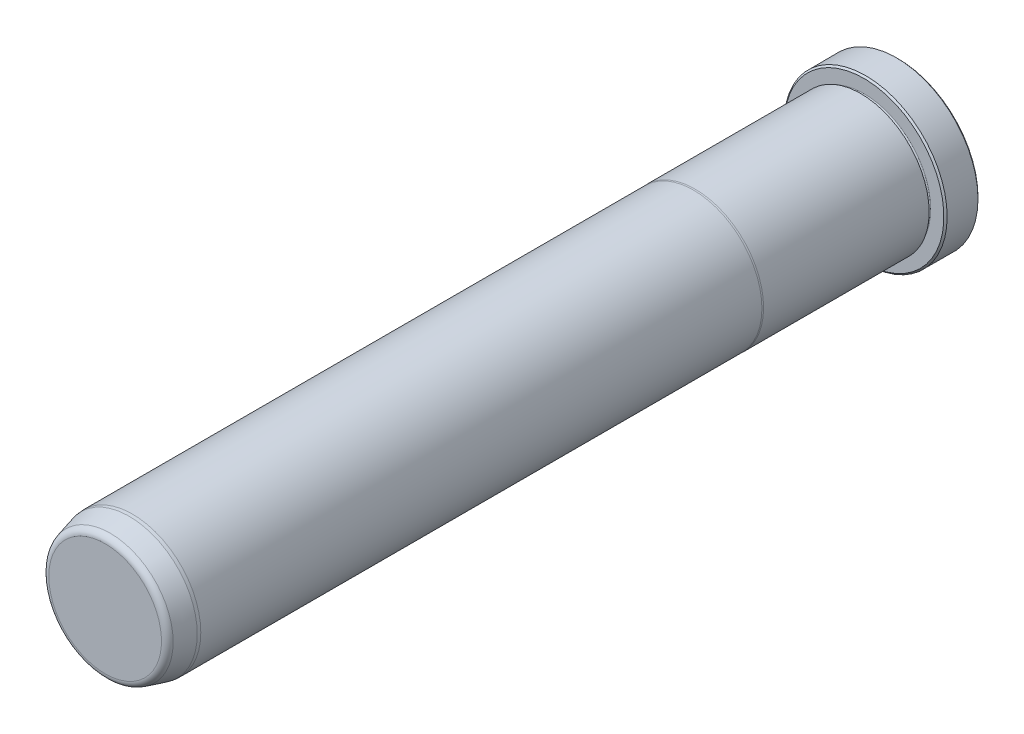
from build123d import *

# Parameters (mm, degrees)
FILLET6_R     = 1.5875
CHAMFER1_SIZE = 0.381


with BuildPart() as part:
    # Sketch1 → Revolve1 (revolve)
    with BuildSketch(Plane(origin=(0, 0, 0), x_dir=(0, 0, -1), z_dir=(1, 0, 0)), mode=Mode.PRIVATE) as revolve1_sk:
        with BuildLine():
            Line((0, 0), (0, 18.923))
            Line((0, 18.923), (-7.9248, 18.923))
            Line((-7.9248, 18.923), (-7.9248, 15.4813))
            ThreePointArc((-7.9248, 15.4813), (-8.3058, 15.1003), (-8.6868, 15.4813))
            Line((-8.6868, 15.4813), (-8.6868, 15.8877))
            Line((-8.6868, 15.8877), (-47.134763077, 15.8877))
            Line((-47.134763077, 15.8877), (-47.498, 15.8623))
            Line((-47.498, 15.8623), (-177.8, 15.8623))
            Line((-177.8, 15.8623), (-178.562, 15.795633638))
            Line((-178.562, 15.795633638), (-184.15, 14.298333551))
            Line((-184.15, 14.298333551), (-184.15, 0))
            Line((-184.15, 0), (0, 0))
        make_face()
    revolve(revolve1_sk.sketch.rotate(Axis((0, 0, 0), (0, 0, -1)), 90), axis=Axis((0, 0, 0), (0, 0, -1)))

    # Fillet6
    fillet6_edges = [part.edges().sort_by_distance(p)[0] for p in [
        (-14.298333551, 0, 184.15),
    ]]
    fillet(fillet6_edges, radius=FILLET6_R)

    # Chamfer1
    chamfer1_edges = [part.edges().sort_by_distance(p)[0] for p in [
        (-18.923, 0, 7.9248),
        (-18.923, 0, 0),
    ]]
    chamfer(chamfer1_edges, length=CHAMFER1_SIZE)


solid = part.part
